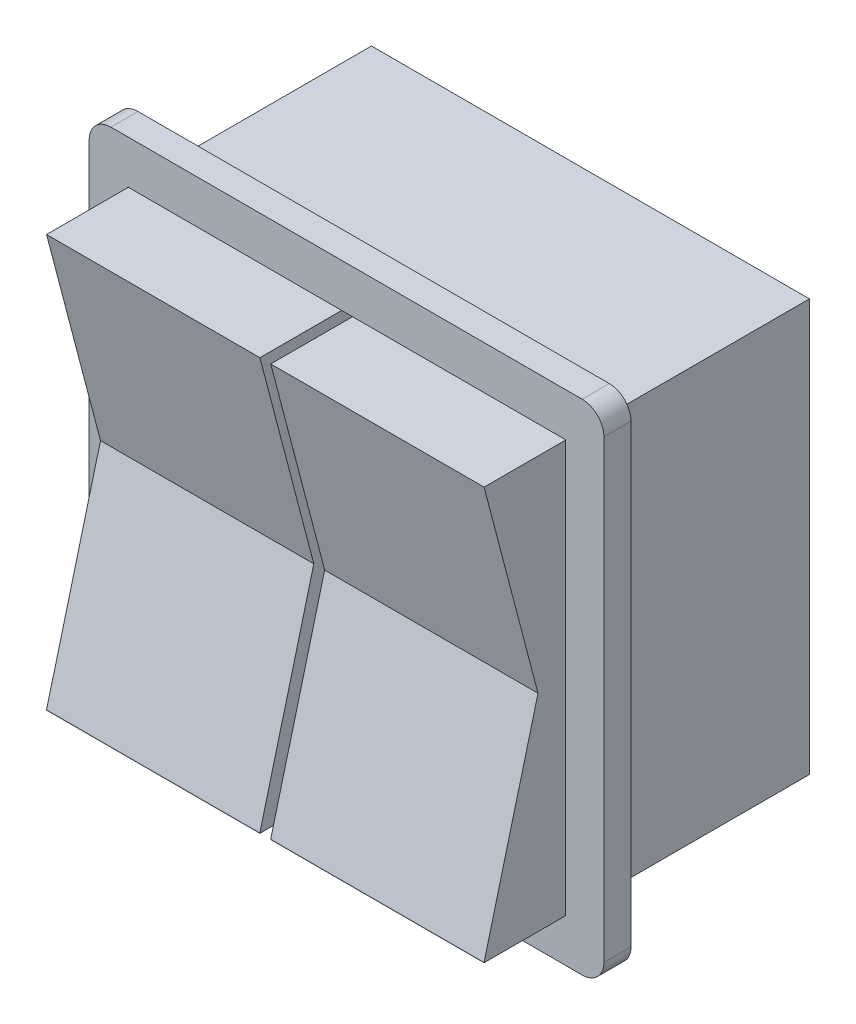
ISO-10303-21;
HEADER;
FILE_DESCRIPTION(('STEP AP214'),'2;1');
FILE_NAME('part.step','',(''),(''),'','','');
FILE_SCHEMA(('AUTOMOTIVE_DESIGN { 1 0 10303 214 1 1 1 1 }'));
ENDSEC;
DATA;
#1=APPLICATION_CONTEXT('core data for automotive mechanical design processes');
#2=APPLICATION_PROTOCOL_DEFINITION('international standard','automotive_design',2000,#1);
#3=PRODUCT_CONTEXT('',#1,'mechanical');
#4=PRODUCT('Part','Part','',(#3));
#5=PRODUCT_RELATED_PRODUCT_CATEGORY('part','',(#4));
#6=PRODUCT_DEFINITION_FORMATION('','',#4);
#7=PRODUCT_DEFINITION_CONTEXT('part definition',#1,'design');
#8=PRODUCT_DEFINITION('design','',#6,#7);
#9=PRODUCT_DEFINITION_SHAPE('','',#8);
#10=(LENGTH_UNIT() NAMED_UNIT(*) SI_UNIT(.MILLI.,.METRE.));
#11=(NAMED_UNIT(*) PLANE_ANGLE_UNIT() SI_UNIT($,.RADIAN.));
#12=(NAMED_UNIT(*) SI_UNIT($,.STERADIAN.) SOLID_ANGLE_UNIT());
#13=UNCERTAINTY_MEASURE_WITH_UNIT(LENGTH_MEASURE(1.E-05),#10,'distance_accuracy_value','');
#14=(GEOMETRIC_REPRESENTATION_CONTEXT(3) GLOBAL_UNCERTAINTY_ASSIGNED_CONTEXT((#13)) GLOBAL_UNIT_ASSIGNED_CONTEXT((#10,
#11,#12)) REPRESENTATION_CONTEXT('',''));
#15=CARTESIAN_POINT('',(0.,0.,0.));
#16=DIRECTION('',(0.,0.,1.));
#17=DIRECTION('',(1.,0.,0.));
#18=AXIS2_PLACEMENT_3D('',#15,#16,#17);
#19=CARTESIAN_POINT('',(-25.6186756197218,24.0720067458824,38.1));
#20=DIRECTION('',(0.,-1.,0.));
#21=DIRECTION('',(0.,0.,-1.));
#22=AXIS2_PLACEMENT_3D('',#19,#20,#21);
#23=PLANE('',#22);
#24=DIRECTION('',(-1.,0.,0.));
#25=VECTOR('',#24,1.);
#26=CARTESIAN_POINT('',(-25.6186756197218,24.0720067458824,25.4));
#27=LINE('',#26,#25);
#28=CARTESIAN_POINT('',(-0.626315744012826,24.0720067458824,25.4));
#29=VERTEX_POINT('',#28);
#30=CARTESIAN_POINT('',(-25.6186756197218,24.0720067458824,25.4));
#31=VERTEX_POINT('',#30);
#32=EDGE_CURVE('E65',#29,#31,#27,.T.);
#33=ORIENTED_EDGE('',*,*,#32,.T.);
#34=DIRECTION('',(0.,0.,-1.));
#35=VECTOR('',#34,1.);
#36=CARTESIAN_POINT('',(-25.6186756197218,24.0720067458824,38.1));
#37=LINE('',#36,#35);
#38=CARTESIAN_POINT('',(-25.6186756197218,24.0720067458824,38.1));
#39=VERTEX_POINT('',#38);
#40=EDGE_CURVE('E150',#39,#31,#37,.T.);
#41=ORIENTED_EDGE('',*,*,#40,.F.);
#42=DIRECTION('',(-1.,0.,0.));
#43=VECTOR('',#42,1.);
#44=CARTESIAN_POINT('',(-25.6186756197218,24.0720067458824,38.1));
#45=LINE('',#44,#43);
#46=CARTESIAN_POINT('',(-0.626315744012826,24.0720067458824,38.1));
#47=VERTEX_POINT('',#46);
#48=EDGE_CURVE('E134',#47,#39,#45,.T.);
#49=ORIENTED_EDGE('',*,*,#48,.F.);
#50=DIRECTION('',(0.,0.,-1.));
#51=VECTOR('',#50,1.);
#52=CARTESIAN_POINT('',(-0.626315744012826,24.0720067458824,38.1));
#53=LINE('',#52,#51);
#54=EDGE_CURVE('E139',#47,#29,#53,.T.);
#55=ORIENTED_EDGE('',*,*,#54,.T.);
#56=EDGE_LOOP('',(#33,#41,#49,#55));
#57=FACE_BOUND('',#56,.T.);
#58=ADVANCED_FACE('F56',(#57),#23,.F.);
#59=CARTESIAN_POINT('',(-25.6186756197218,-24.1879932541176,38.1));
#60=DIRECTION('',(1.,0.,0.));
#61=DIRECTION('',(0.,0.,-1.));
#62=AXIS2_PLACEMENT_3D('',#59,#60,#61);
#63=PLANE('',#62);
#64=DIRECTION('',(0.,-1.,0.));
#65=VECTOR('',#64,1.);
#66=CARTESIAN_POINT('',(-25.6186756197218,-24.1879932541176,38.1));
#67=LINE('',#66,#65);
#68=CARTESIAN_POINT('',(-25.6186756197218,-24.1300000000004,38.1));
#69=VERTEX_POINT('',#68);
#70=CARTESIAN_POINT('',(-25.6186756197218,-24.1879932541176,38.1));
#71=VERTEX_POINT('',#70);
#72=EDGE_CURVE('E93',#69,#71,#67,.T.);
#73=ORIENTED_EDGE('',*,*,#72,.F.);
#74=DIRECTION('',(0.,-0.967409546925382,0.253216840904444));
#75=VECTOR('',#74,1.);
#76=CARTESIAN_POINT('',(-25.6186756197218,0.,31.7840375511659));
#77=LINE('',#76,#75);
#78=CARTESIAN_POINT('',(-25.6186756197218,0.,31.7840375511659));
#79=VERTEX_POINT('',#78);
#80=EDGE_CURVE('E119',#79,#69,#77,.T.);
#81=ORIENTED_EDGE('',*,*,#80,.F.);
#82=DIRECTION('',(0.,-0.967259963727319,-0.253787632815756));
#83=VECTOR('',#82,1.);
#84=CARTESIAN_POINT('',(-25.6186756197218,0.,31.7840375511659));
#85=LINE('',#84,#83);
#86=EDGE_CURVE('E127',#39,#79,#85,.T.);
#87=ORIENTED_EDGE('',*,*,#86,.F.);
#88=ORIENTED_EDGE('',*,*,#40,.T.);
#89=DIRECTION('',(0.,-1.,0.));
#90=VECTOR('',#89,1.);
#91=CARTESIAN_POINT('',(-25.6186756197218,-24.1879932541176,25.4));
#92=LINE('',#91,#90);
#93=CARTESIAN_POINT('',(-25.6186756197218,-24.1879932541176,25.4));
#94=VERTEX_POINT('',#93);
#95=EDGE_CURVE('E73',#31,#94,#92,.T.);
#96=ORIENTED_EDGE('',*,*,#95,.T.);
#97=DIRECTION('',(0.,0.,-1.));
#98=VECTOR('',#97,1.);
#99=CARTESIAN_POINT('',(-25.6186756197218,-24.1879932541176,38.1));
#100=LINE('',#99,#98);
#101=EDGE_CURVE('E133',#71,#94,#100,.T.);
#102=ORIENTED_EDGE('',*,*,#101,.F.);
#103=EDGE_LOOP('',(#73,#81,#87,#88,#96,#102));
#104=FACE_BOUND('',#103,.T.);
#105=ADVANCED_FACE('F131',(#104),#63,.F.);
#106=CARTESIAN_POINT('',(-25.6186756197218,-24.1879932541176,38.1));
#107=DIRECTION('',(0.,1.,0.));
#108=DIRECTION('',(0.,0.,1.));
#109=AXIS2_PLACEMENT_3D('',#106,#107,#108);
#110=PLANE('',#109);
#111=DIRECTION('',(1.,0.,0.));
#112=VECTOR('',#111,1.);
#113=CARTESIAN_POINT('',(-25.6186756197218,-24.1879932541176,25.4));
#114=LINE('',#113,#112);
#115=CARTESIAN_POINT('',(-0.626315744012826,-24.1879932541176,25.4));
#116=VERTEX_POINT('',#115);
#117=EDGE_CURVE('E143',#94,#116,#114,.T.);
#118=ORIENTED_EDGE('',*,*,#117,.T.);
#119=DIRECTION('',(0.,0.,-1.));
#120=VECTOR('',#119,1.);
#121=CARTESIAN_POINT('',(-0.626315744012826,-24.1879932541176,38.1));
#122=LINE('',#121,#120);
#123=CARTESIAN_POINT('',(-0.626315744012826,-24.1879932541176,38.1));
#124=VERTEX_POINT('',#123);
#125=EDGE_CURVE('E147',#124,#116,#122,.T.);
#126=ORIENTED_EDGE('',*,*,#125,.F.);
#127=DIRECTION('',(1.,0.,0.));
#128=VECTOR('',#127,1.);
#129=CARTESIAN_POINT('',(-25.6186756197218,-24.1879932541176,38.1));
#130=LINE('',#129,#128);
#131=EDGE_CURVE('E88',#71,#124,#130,.T.);
#132=ORIENTED_EDGE('',*,*,#131,.F.);
#133=ORIENTED_EDGE('',*,*,#101,.T.);
#134=EDGE_LOOP('',(#118,#126,#132,#133));
#135=FACE_BOUND('',#134,.T.);
#136=ADVANCED_FACE('F165',(#135),#110,.F.);
#137=CARTESIAN_POINT('',(-0.626315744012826,-24.1879932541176,38.1));
#138=DIRECTION('',(-1.,0.,0.));
#139=DIRECTION('',(0.,0.,1.));
#140=AXIS2_PLACEMENT_3D('',#137,#138,#139);
#141=PLANE('',#140);
#142=DIRECTION('',(0.,-0.967259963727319,-0.253787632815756));
#143=VECTOR('',#142,1.);
#144=CARTESIAN_POINT('',(-0.626315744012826,-21.0796553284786,26.25320196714));
#145=LINE('',#144,#143);
#146=CARTESIAN_POINT('',(-0.626315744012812,0.,31.7840375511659));
#147=VERTEX_POINT('',#146);
#148=EDGE_CURVE('E154',#47,#147,#145,.T.);
#149=ORIENTED_EDGE('',*,*,#148,.T.);
#150=DIRECTION('',(0.,-0.967409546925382,0.253216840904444));
#151=VECTOR('',#150,1.);
#152=CARTESIAN_POINT('',(-0.626315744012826,-24.1842747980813,38.1142062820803));
#153=LINE('',#152,#151);
#154=CARTESIAN_POINT('',(-0.626315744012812,-24.1300000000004,38.1));
#155=VERTEX_POINT('',#154);
#156=EDGE_CURVE('E152',#147,#155,#153,.T.);
#157=ORIENTED_EDGE('',*,*,#156,.T.);
#158=DIRECTION('',(0.,1.,0.));
#159=VECTOR('',#158,1.);
#160=CARTESIAN_POINT('',(-0.626315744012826,-24.1879932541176,38.1));
#161=LINE('',#160,#159);
#162=EDGE_CURVE('E130',#124,#155,#161,.T.);
#163=ORIENTED_EDGE('',*,*,#162,.F.);
#164=ORIENTED_EDGE('',*,*,#125,.T.);
#165=DIRECTION('',(0.,1.,0.));
#166=VECTOR('',#165,1.);
#167=CARTESIAN_POINT('',(-0.626315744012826,-24.1879932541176,25.4));
#168=LINE('',#167,#166);
#169=EDGE_CURVE('E101',#116,#29,#168,.T.);
#170=ORIENTED_EDGE('',*,*,#169,.T.);
#171=ORIENTED_EDGE('',*,*,#54,.F.);
#172=EDGE_LOOP('',(#149,#157,#163,#164,#170,#171));
#173=FACE_BOUND('',#172,.T.);
#174=ADVANCED_FACE('F166',(#173),#141,.F.);
#175=CARTESIAN_POINT('',(0.,0.,38.1));
#176=DIRECTION('',(0.,0.,1.));
#177=DIRECTION('',(1.,0.,0.));
#178=AXIS2_PLACEMENT_3D('',#175,#176,#177);
#179=PLANE('',#178);
#180=DIRECTION('',(1.,0.,0.));
#181=VECTOR('',#180,1.);
#182=CARTESIAN_POINT('',(0.,-24.1300000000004,38.1));
#183=LINE('',#182,#181);
#184=EDGE_CURVE('E12',#69,#155,#183,.T.);
#185=ORIENTED_EDGE('',*,*,#184,.F.);
#186=ORIENTED_EDGE('',*,*,#72,.T.);
#187=ORIENTED_EDGE('',*,*,#131,.T.);
#188=ORIENTED_EDGE('',*,*,#162,.T.);
#189=EDGE_LOOP('',(#185,#186,#187,#188));
#190=FACE_BOUND('',#189,.T.);
#191=ADVANCED_FACE('F58',(#190),#179,.T.);
#192=CARTESIAN_POINT('',(0.,0.,25.4));
#193=DIRECTION('',(0.,0.,1.));
#194=DIRECTION('',(1.,0.,0.));
#195=AXIS2_PLACEMENT_3D('',#192,#193,#194);
#196=PLANE('',#195);
#197=ORIENTED_EDGE('',*,*,#32,.F.);
#198=ORIENTED_EDGE('',*,*,#169,.F.);
#199=ORIENTED_EDGE('',*,*,#117,.F.);
#200=ORIENTED_EDGE('',*,*,#95,.F.);
#201=EDGE_LOOP('',(#197,#198,#199,#200));
#202=FACE_BOUND('',#201,.T.);
#203=ADVANCED_FACE('F163',(#202),#196,.F.);
#204=CARTESIAN_POINT('',(228.381324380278,0.,31.7840375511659));
#205=DIRECTION('',(0.,-0.253216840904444,-0.967409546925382));
#206=DIRECTION('',(0.,0.967409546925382,-0.253216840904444));
#207=AXIS2_PLACEMENT_3D('',#204,#205,#206);
#208=PLANE('',#207);
#209=DIRECTION('',(-1.,0.,0.));
#210=VECTOR('',#209,1.);
#211=CARTESIAN_POINT('',(228.381324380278,0.,31.7840375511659));
#212=LINE('',#211,#210);
#213=EDGE_CURVE('E123',#147,#79,#212,.T.);
#214=ORIENTED_EDGE('',*,*,#213,.T.);
#215=ORIENTED_EDGE('',*,*,#80,.T.);
#216=ORIENTED_EDGE('',*,*,#184,.T.);
#217=ORIENTED_EDGE('',*,*,#156,.F.);
#218=EDGE_LOOP('',(#214,#215,#216,#217));
#219=FACE_BOUND('',#218,.T.);
#220=ADVANCED_FACE('F120',(#219),#208,.F.);
#221=CARTESIAN_POINT('',(228.381324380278,0.,31.7840375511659));
#222=DIRECTION('',(0.,0.253787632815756,-0.967259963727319));
#223=DIRECTION('',(0.,0.967259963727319,0.253787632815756));
#224=AXIS2_PLACEMENT_3D('',#221,#222,#223);
#225=PLANE('',#224);
#226=ORIENTED_EDGE('',*,*,#48,.T.);
#227=ORIENTED_EDGE('',*,*,#86,.T.);
#228=ORIENTED_EDGE('',*,*,#213,.F.);
#229=ORIENTED_EDGE('',*,*,#148,.F.);
#230=EDGE_LOOP('',(#226,#227,#228,#229));
#231=FACE_BOUND('',#230,.T.);
#232=ADVANCED_FACE('F159',(#231),#225,.F.);
#233=CLOSED_SHELL('',(#58,#105,#136,#174,#191,#203,#220,#232));
#234=MANIFOLD_SOLID_BREP('B2',#233);
#235=CARTESIAN_POINT('',(0.645544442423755,24.0720067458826,38.1));
#236=DIRECTION('',(0.,-1.,0.));
#237=DIRECTION('',(0.,0.,-1.));
#238=AXIS2_PLACEMENT_3D('',#235,#236,#237);
#239=PLANE('',#238);
#240=DIRECTION('',(-1.,0.,0.));
#241=VECTOR('',#240,1.);
#242=CARTESIAN_POINT('',(0.645544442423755,24.0720067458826,25.4));
#243=LINE('',#242,#241);
#244=CARTESIAN_POINT('',(25.6379043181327,24.0720067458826,25.4));
#245=VERTEX_POINT('',#244);
#246=CARTESIAN_POINT('',(0.645544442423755,24.0720067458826,25.4));
#247=VERTEX_POINT('',#246);
#248=EDGE_CURVE('E356',#245,#247,#243,.T.);
#249=ORIENTED_EDGE('',*,*,#248,.T.);
#250=DIRECTION('',(0.,0.,-1.));
#251=VECTOR('',#250,1.);
#252=CARTESIAN_POINT('',(0.645544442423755,24.0720067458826,38.1));
#253=LINE('',#252,#251);
#254=CARTESIAN_POINT('',(0.645544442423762,24.0720067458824,38.1));
#255=VERTEX_POINT('',#254);
#256=EDGE_CURVE('E286',#255,#247,#253,.T.);
#257=ORIENTED_EDGE('',*,*,#256,.F.);
#258=DIRECTION('',(-1.,0.,0.));
#259=VECTOR('',#258,1.);
#260=CARTESIAN_POINT('',(0.645544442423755,24.0720067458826,38.1));
#261=LINE('',#260,#259);
#262=CARTESIAN_POINT('',(25.6379043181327,24.0720067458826,38.1));
#263=VERTEX_POINT('',#262);
#264=EDGE_CURVE('E339',#263,#255,#261,.T.);
#265=ORIENTED_EDGE('',*,*,#264,.F.);
#266=DIRECTION('',(0.,0.,-1.));
#267=VECTOR('',#266,1.);
#268=CARTESIAN_POINT('',(25.6379043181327,24.0720067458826,38.1));
#269=LINE('',#268,#267);
#270=EDGE_CURVE('E362',#263,#245,#269,.T.);
#271=ORIENTED_EDGE('',*,*,#270,.T.);
#272=EDGE_LOOP('',(#249,#257,#265,#271));
#273=FACE_BOUND('',#272,.T.);
#274=ADVANCED_FACE('F278',(#273),#239,.F.);
#275=CARTESIAN_POINT('',(0.645544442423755,-24.1879932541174,38.1));
#276=DIRECTION('',(1.,0.,0.));
#277=DIRECTION('',(0.,0.,-1.));
#278=AXIS2_PLACEMENT_3D('',#275,#276,#277);
#279=PLANE('',#278);
#280=DIRECTION('',(0.,-1.,0.));
#281=VECTOR('',#280,1.);
#282=CARTESIAN_POINT('',(0.645544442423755,-24.1879932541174,38.1));
#283=LINE('',#282,#281);
#284=CARTESIAN_POINT('',(0.645544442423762,-24.1300000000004,38.1));
#285=VERTEX_POINT('',#284);
#286=CARTESIAN_POINT('',(0.645544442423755,-24.1879932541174,38.1));
#287=VERTEX_POINT('',#286);
#288=EDGE_CURVE('E324',#285,#287,#283,.T.);
#289=ORIENTED_EDGE('',*,*,#288,.F.);
#290=DIRECTION('',(0.,0.967409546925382,-0.253216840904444));
#291=VECTOR('',#290,1.);
#292=CARTESIAN_POINT('',(0.645544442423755,-24.1842747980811,38.1142062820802));
#293=LINE('',#292,#291);
#294=CARTESIAN_POINT('',(0.645544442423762,0.,31.7840375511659));
#295=VERTEX_POINT('',#294);
#296=EDGE_CURVE('E352',#285,#295,#293,.T.);
#297=ORIENTED_EDGE('',*,*,#296,.T.);
#298=DIRECTION('',(0.,0.967259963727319,0.253787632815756));
#299=VECTOR('',#298,1.);
#300=CARTESIAN_POINT('',(0.645544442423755,-21.0796553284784,26.2532019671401));
#301=LINE('',#300,#299);
#302=EDGE_CURVE('E342',#295,#255,#301,.T.);
#303=ORIENTED_EDGE('',*,*,#302,.T.);
#304=ORIENTED_EDGE('',*,*,#256,.T.);
#305=DIRECTION('',(0.,-1.,0.));
#306=VECTOR('',#305,1.);
#307=CARTESIAN_POINT('',(0.645544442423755,-24.1879932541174,25.4));
#308=LINE('',#307,#306);
#309=CARTESIAN_POINT('',(0.645544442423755,-24.1879932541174,25.4));
#310=VERTEX_POINT('',#309);
#311=EDGE_CURVE('E367',#247,#310,#308,.T.);
#312=ORIENTED_EDGE('',*,*,#311,.T.);
#313=DIRECTION('',(0.,0.,-1.));
#314=VECTOR('',#313,1.);
#315=CARTESIAN_POINT('',(0.645544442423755,-24.1879932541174,38.1));
#316=LINE('',#315,#314);
#317=EDGE_CURVE('E357',#287,#310,#316,.T.);
#318=ORIENTED_EDGE('',*,*,#317,.F.);
#319=EDGE_LOOP('',(#289,#297,#303,#304,#312,#318));
#320=FACE_BOUND('',#319,.T.);
#321=ADVANCED_FACE('F350',(#320),#279,.F.);
#322=CARTESIAN_POINT('',(0.645544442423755,-24.1879932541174,38.1));
#323=DIRECTION('',(0.,1.,0.));
#324=DIRECTION('',(0.,0.,1.));
#325=AXIS2_PLACEMENT_3D('',#322,#323,#324);
#326=PLANE('',#325);
#327=DIRECTION('',(1.,0.,0.));
#328=VECTOR('',#327,1.);
#329=CARTESIAN_POINT('',(0.645544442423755,-24.1879932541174,25.4));
#330=LINE('',#329,#328);
#331=CARTESIAN_POINT('',(25.6379043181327,-24.1879932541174,25.4));
#332=VERTEX_POINT('',#331);
#333=EDGE_CURVE('E313',#310,#332,#330,.T.);
#334=ORIENTED_EDGE('',*,*,#333,.T.);
#335=DIRECTION('',(0.,0.,-1.));
#336=VECTOR('',#335,1.);
#337=CARTESIAN_POINT('',(25.6379043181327,-24.1879932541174,38.1));
#338=LINE('',#337,#336);
#339=CARTESIAN_POINT('',(25.6379043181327,-24.1879932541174,38.1));
#340=VERTEX_POINT('',#339);
#341=EDGE_CURVE('E358',#340,#332,#338,.T.);
#342=ORIENTED_EDGE('',*,*,#341,.F.);
#343=DIRECTION('',(1.,0.,0.));
#344=VECTOR('',#343,1.);
#345=CARTESIAN_POINT('',(0.645544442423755,-24.1879932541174,38.1));
#346=LINE('',#345,#344);
#347=EDGE_CURVE('E372',#287,#340,#346,.T.);
#348=ORIENTED_EDGE('',*,*,#347,.F.);
#349=ORIENTED_EDGE('',*,*,#317,.T.);
#350=EDGE_LOOP('',(#334,#342,#348,#349));
#351=FACE_BOUND('',#350,.T.);
#352=ADVANCED_FACE('F387',(#351),#326,.F.);
#353=CARTESIAN_POINT('',(25.6379043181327,-24.1879932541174,38.1));
#354=DIRECTION('',(-1.,0.,0.));
#355=DIRECTION('',(0.,0.,1.));
#356=AXIS2_PLACEMENT_3D('',#353,#354,#355);
#357=PLANE('',#356);
#358=DIRECTION('',(0.,-0.967259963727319,-0.253787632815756));
#359=VECTOR('',#358,1.);
#360=CARTESIAN_POINT('',(25.6379043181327,-21.0796553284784,26.2532019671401));
#361=LINE('',#360,#359);
#362=CARTESIAN_POINT('',(25.6379043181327,0.,31.7840375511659));
#363=VERTEX_POINT('',#362);
#364=EDGE_CURVE('E294',#263,#363,#361,.T.);
#365=ORIENTED_EDGE('',*,*,#364,.T.);
#366=DIRECTION('',(0.,-0.967409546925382,0.253216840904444));
#367=VECTOR('',#366,1.);
#368=CARTESIAN_POINT('',(25.6379043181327,-24.1842747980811,38.1142062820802));
#369=LINE('',#368,#367);
#370=CARTESIAN_POINT('',(25.6379043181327,-24.1300000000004,38.1));
#371=VERTEX_POINT('',#370);
#372=EDGE_CURVE('E353',#363,#371,#369,.T.);
#373=ORIENTED_EDGE('',*,*,#372,.T.);
#374=DIRECTION('',(0.,1.,0.));
#375=VECTOR('',#374,1.);
#376=CARTESIAN_POINT('',(25.6379043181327,-24.1879932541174,38.1));
#377=LINE('',#376,#375);
#378=EDGE_CURVE('E364',#340,#371,#377,.T.);
#379=ORIENTED_EDGE('',*,*,#378,.F.);
#380=ORIENTED_EDGE('',*,*,#341,.T.);
#381=DIRECTION('',(0.,1.,0.));
#382=VECTOR('',#381,1.);
#383=CARTESIAN_POINT('',(25.6379043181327,-24.1879932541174,25.4));
#384=LINE('',#383,#382);
#385=EDGE_CURVE('E318',#332,#245,#384,.T.);
#386=ORIENTED_EDGE('',*,*,#385,.T.);
#387=ORIENTED_EDGE('',*,*,#270,.F.);
#388=EDGE_LOOP('',(#365,#373,#379,#380,#386,#387));
#389=FACE_BOUND('',#388,.T.);
#390=ADVANCED_FACE('F382',(#389),#357,.F.);
#391=CARTESIAN_POINT('',(0.,0.,38.1));
#392=DIRECTION('',(0.,0.,1.));
#393=DIRECTION('',(1.,0.,0.));
#394=AXIS2_PLACEMENT_3D('',#391,#392,#393);
#395=PLANE('',#394);
#396=DIRECTION('',(1.,0.,0.));
#397=VECTOR('',#396,1.);
#398=CARTESIAN_POINT('',(0.,-24.1300000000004,38.1));
#399=LINE('',#398,#397);
#400=EDGE_CURVE('E54',#285,#371,#399,.T.);
#401=ORIENTED_EDGE('',*,*,#400,.F.);
#402=ORIENTED_EDGE('',*,*,#288,.T.);
#403=ORIENTED_EDGE('',*,*,#347,.T.);
#404=ORIENTED_EDGE('',*,*,#378,.T.);
#405=EDGE_LOOP('',(#401,#402,#403,#404));
#406=FACE_BOUND('',#405,.T.);
#407=ADVANCED_FACE('F388',(#406),#395,.T.);
#408=CARTESIAN_POINT('',(0.,0.,25.4));
#409=DIRECTION('',(0.,0.,1.));
#410=DIRECTION('',(1.,0.,0.));
#411=AXIS2_PLACEMENT_3D('',#408,#409,#410);
#412=PLANE('',#411);
#413=ORIENTED_EDGE('',*,*,#248,.F.);
#414=ORIENTED_EDGE('',*,*,#385,.F.);
#415=ORIENTED_EDGE('',*,*,#333,.F.);
#416=ORIENTED_EDGE('',*,*,#311,.F.);
#417=EDGE_LOOP('',(#413,#414,#415,#416));
#418=FACE_BOUND('',#417,.T.);
#419=ADVANCED_FACE('F385',(#418),#412,.F.);
#420=CARTESIAN_POINT('',(228.381324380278,0.,31.7840375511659));
#421=DIRECTION('',(0.,-0.253216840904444,-0.967409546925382));
#422=DIRECTION('',(0.,0.967409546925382,-0.253216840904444));
#423=AXIS2_PLACEMENT_3D('',#420,#421,#422);
#424=PLANE('',#423);
#425=ORIENTED_EDGE('',*,*,#400,.T.);
#426=ORIENTED_EDGE('',*,*,#372,.F.);
#427=DIRECTION('',(-1.,0.,0.));
#428=VECTOR('',#427,1.);
#429=CARTESIAN_POINT('',(228.381324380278,0.,31.7840375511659));
#430=LINE('',#429,#428);
#431=EDGE_CURVE('E379',#363,#295,#430,.T.);
#432=ORIENTED_EDGE('',*,*,#431,.T.);
#433=ORIENTED_EDGE('',*,*,#296,.F.);
#434=EDGE_LOOP('',(#425,#426,#432,#433));
#435=FACE_BOUND('',#434,.T.);
#436=ADVANCED_FACE('F381',(#435),#424,.F.);
#437=CARTESIAN_POINT('',(228.381324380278,0.,31.7840375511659));
#438=DIRECTION('',(0.,0.253787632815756,-0.967259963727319));
#439=DIRECTION('',(0.,0.967259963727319,0.253787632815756));
#440=AXIS2_PLACEMENT_3D('',#437,#438,#439);
#441=PLANE('',#440);
#442=ORIENTED_EDGE('',*,*,#431,.F.);
#443=ORIENTED_EDGE('',*,*,#364,.F.);
#444=ORIENTED_EDGE('',*,*,#264,.T.);
#445=ORIENTED_EDGE('',*,*,#302,.F.);
#446=EDGE_LOOP('',(#442,#443,#444,#445));
#447=FACE_BOUND('',#446,.T.);
#448=ADVANCED_FACE('F341',(#447),#441,.F.);
#449=CLOSED_SHELL('',(#274,#321,#352,#390,#407,#419,#436,#448));
#450=MANIFOLD_SOLID_BREP('B6',#449);
#451=CARTESIAN_POINT('',(-27.6098,-26.67,28.575));
#452=DIRECTION('',(0.,0.,-1.));
#453=DIRECTION('',(-1.,0.,0.));
#454=AXIS2_PLACEMENT_3D('',#451,#452,#453);
#455=PLANE('',#454);
#456=CARTESIAN_POINT('',(-27.6098,-26.67,28.575));
#457=DIRECTION('',(0.,0.,1.));
#458=DIRECTION('',(-1.,0.,0.));
#459=AXIS2_PLACEMENT_3D('',#456,#457,#458);
#460=CIRCLE('',#459,2.54);
#461=CARTESIAN_POINT('',(-30.1498,-26.67,28.575));
#462=VERTEX_POINT('',#461);
#463=CARTESIAN_POINT('',(-27.6098,-29.21,28.575));
#464=VERTEX_POINT('',#463);
#465=EDGE_CURVE('E624',#462,#464,#460,.T.);
#466=ORIENTED_EDGE('',*,*,#465,.T.);
#467=DIRECTION('',(1.,0.,0.));
#468=VECTOR('',#467,1.);
#469=CARTESIAN_POINT('',(-27.6098,-29.21,28.575));
#470=LINE('',#469,#468);
#471=CARTESIAN_POINT('',(27.6098,-29.21,28.575));
#472=VERTEX_POINT('',#471);
#473=EDGE_CURVE('E627',#464,#472,#470,.T.);
#474=ORIENTED_EDGE('',*,*,#473,.T.);
#475=CARTESIAN_POINT('',(27.6098,-26.67,28.575));
#476=DIRECTION('',(0.,0.,1.));
#477=DIRECTION('',(1.,0.,0.));
#478=AXIS2_PLACEMENT_3D('',#475,#476,#477);
#479=CIRCLE('',#478,2.54);
#480=CARTESIAN_POINT('',(30.1498,-26.67,28.575));
#481=VERTEX_POINT('',#480);
#482=EDGE_CURVE('E630',#472,#481,#479,.T.);
#483=ORIENTED_EDGE('',*,*,#482,.T.);
#484=DIRECTION('',(0.,1.,0.));
#485=VECTOR('',#484,1.);
#486=CARTESIAN_POINT('',(30.1498,-26.67,28.575));
#487=LINE('',#486,#485);
#488=CARTESIAN_POINT('',(30.1498,26.67,28.575));
#489=VERTEX_POINT('',#488);
#490=EDGE_CURVE('E632',#481,#489,#487,.T.);
#491=ORIENTED_EDGE('',*,*,#490,.T.);
#492=CARTESIAN_POINT('',(27.6098,26.67,28.575));
#493=DIRECTION('',(0.,0.,1.));
#494=DIRECTION('',(-1.,0.,0.));
#495=AXIS2_PLACEMENT_3D('',#492,#493,#494);
#496=CIRCLE('',#495,2.54);
#497=CARTESIAN_POINT('',(27.6098,29.21,28.575));
#498=VERTEX_POINT('',#497);
#499=EDGE_CURVE('E634',#489,#498,#496,.T.);
#500=ORIENTED_EDGE('',*,*,#499,.T.);
#501=DIRECTION('',(-1.,0.,0.));
#502=VECTOR('',#501,1.);
#503=CARTESIAN_POINT('',(-27.6098,29.21,28.575));
#504=LINE('',#503,#502);
#505=CARTESIAN_POINT('',(-27.6098,29.21,28.575));
#506=VERTEX_POINT('',#505);
#507=EDGE_CURVE('E636',#498,#506,#504,.T.);
#508=ORIENTED_EDGE('',*,*,#507,.T.);
#509=CARTESIAN_POINT('',(-27.6098,26.67,28.575));
#510=DIRECTION('',(0.,0.,1.));
#511=DIRECTION('',(1.,0.,0.));
#512=AXIS2_PLACEMENT_3D('',#509,#510,#511);
#513=CIRCLE('',#512,2.54);
#514=CARTESIAN_POINT('',(-30.1498,26.67,28.575));
#515=VERTEX_POINT('',#514);
#516=EDGE_CURVE('E638',#506,#515,#513,.T.);
#517=ORIENTED_EDGE('',*,*,#516,.T.);
#518=DIRECTION('',(0.,-1.,0.));
#519=VECTOR('',#518,1.);
#520=CARTESIAN_POINT('',(-30.1498,-26.67,28.575));
#521=LINE('',#520,#519);
#522=EDGE_CURVE('E640',#515,#462,#521,.T.);
#523=ORIENTED_EDGE('',*,*,#522,.T.);
#524=EDGE_LOOP('',(#466,#474,#483,#491,#500,#508,#517,#523));
#525=FACE_BOUND('',#524,.T.);
#526=DIRECTION('',(0.,-1.,0.));
#527=VECTOR('',#526,1.);
#528=CARTESIAN_POINT('',(-25.654,24.13,28.575));
#529=LINE('',#528,#527);
#530=CARTESIAN_POINT('',(-25.654,24.13,28.575));
#531=VERTEX_POINT('',#530);
#532=CARTESIAN_POINT('',(-25.654,-24.13,28.575));
#533=VERTEX_POINT('',#532);
#534=EDGE_CURVE('E588',#531,#533,#529,.T.);
#535=ORIENTED_EDGE('',*,*,#534,.F.);
#536=DIRECTION('',(-1.,0.,0.));
#537=VECTOR('',#536,1.);
#538=CARTESIAN_POINT('',(-25.654,24.13,28.575));
#539=LINE('',#538,#537);
#540=CARTESIAN_POINT('',(25.654,24.13,28.575));
#541=VERTEX_POINT('',#540);
#542=EDGE_CURVE('E610',#541,#531,#539,.T.);
#543=ORIENTED_EDGE('',*,*,#542,.F.);
#544=DIRECTION('',(0.,1.,0.));
#545=VECTOR('',#544,1.);
#546=CARTESIAN_POINT('',(25.654,24.13,28.575));
#547=LINE('',#546,#545);
#548=CARTESIAN_POINT('',(25.654,-24.13,28.575));
#549=VERTEX_POINT('',#548);
#550=EDGE_CURVE('E608',#549,#541,#547,.T.);
#551=ORIENTED_EDGE('',*,*,#550,.F.);
#552=DIRECTION('',(1.,0.,0.));
#553=VECTOR('',#552,1.);
#554=CARTESIAN_POINT('',(-25.654,-24.13,28.575));
#555=LINE('',#554,#553);
#556=EDGE_CURVE('E596',#533,#549,#555,.T.);
#557=ORIENTED_EDGE('',*,*,#556,.F.);
#558=EDGE_LOOP('',(#535,#543,#551,#557));
#559=FACE_BOUND('',#558,.T.);
#560=ADVANCED_FACE('F499',(#525,#559),#455,.F.);
#561=CARTESIAN_POINT('',(-27.6098,-26.67,25.4));
#562=DIRECTION('',(0.,0.,-1.));
#563=DIRECTION('',(-1.,0.,0.));
#564=AXIS2_PLACEMENT_3D('',#561,#562,#563);
#565=PLANE('',#564);
#566=CARTESIAN_POINT('',(-27.6098,-26.67,25.4));
#567=DIRECTION('',(0.,0.,1.));
#568=DIRECTION('',(-1.,0.,0.));
#569=AXIS2_PLACEMENT_3D('',#566,#567,#568);
#570=CIRCLE('',#569,2.54);
#571=CARTESIAN_POINT('',(-30.1498,-26.67,25.4));
#572=VERTEX_POINT('',#571);
#573=CARTESIAN_POINT('',(-27.6098,-29.21,25.4));
#574=VERTEX_POINT('',#573);
#575=EDGE_CURVE('E604',#572,#574,#570,.T.);
#576=ORIENTED_EDGE('',*,*,#575,.F.);
#577=DIRECTION('',(0.,-1.,0.));
#578=VECTOR('',#577,1.);
#579=CARTESIAN_POINT('',(-30.1498,-26.67,25.4));
#580=LINE('',#579,#578);
#581=CARTESIAN_POINT('',(-30.1498,26.67,25.4));
#582=VERTEX_POINT('',#581);
#583=EDGE_CURVE('E628',#582,#572,#580,.T.);
#584=ORIENTED_EDGE('',*,*,#583,.F.);
#585=CARTESIAN_POINT('',(-27.6098,26.67,25.4));
#586=DIRECTION('',(0.,0.,1.));
#587=DIRECTION('',(1.,0.,0.));
#588=AXIS2_PLACEMENT_3D('',#585,#586,#587);
#589=CIRCLE('',#588,2.54);
#590=CARTESIAN_POINT('',(-27.6098,29.21,25.4));
#591=VERTEX_POINT('',#590);
#592=EDGE_CURVE('E655',#591,#582,#589,.T.);
#593=ORIENTED_EDGE('',*,*,#592,.F.);
#594=DIRECTION('',(-1.,0.,0.));
#595=VECTOR('',#594,1.);
#596=CARTESIAN_POINT('',(-27.6098,29.21,25.4));
#597=LINE('',#596,#595);
#598=CARTESIAN_POINT('',(27.6098,29.21,25.4));
#599=VERTEX_POINT('',#598);
#600=EDGE_CURVE('E653',#599,#591,#597,.T.);
#601=ORIENTED_EDGE('',*,*,#600,.F.);
#602=CARTESIAN_POINT('',(27.6098,26.67,25.4));
#603=DIRECTION('',(0.,0.,1.));
#604=DIRECTION('',(-1.,0.,0.));
#605=AXIS2_PLACEMENT_3D('',#602,#603,#604);
#606=CIRCLE('',#605,2.54);
#607=CARTESIAN_POINT('',(30.1498,26.67,25.4));
#608=VERTEX_POINT('',#607);
#609=EDGE_CURVE('E651',#608,#599,#606,.T.);
#610=ORIENTED_EDGE('',*,*,#609,.F.);
#611=DIRECTION('',(0.,1.,0.));
#612=VECTOR('',#611,1.);
#613=CARTESIAN_POINT('',(30.1498,-26.67,25.4));
#614=LINE('',#613,#612);
#615=CARTESIAN_POINT('',(30.1498,-26.67,25.4));
#616=VERTEX_POINT('',#615);
#617=EDGE_CURVE('E649',#616,#608,#614,.T.);
#618=ORIENTED_EDGE('',*,*,#617,.F.);
#619=CARTESIAN_POINT('',(27.6098,-26.67,25.4));
#620=DIRECTION('',(0.,0.,1.));
#621=DIRECTION('',(1.,0.,0.));
#622=AXIS2_PLACEMENT_3D('',#619,#620,#621);
#623=CIRCLE('',#622,2.54);
#624=CARTESIAN_POINT('',(27.6098,-29.21,25.4));
#625=VERTEX_POINT('',#624);
#626=EDGE_CURVE('E647',#625,#616,#623,.T.);
#627=ORIENTED_EDGE('',*,*,#626,.F.);
#628=DIRECTION('',(1.,0.,0.));
#629=VECTOR('',#628,1.);
#630=CARTESIAN_POINT('',(-27.6098,-29.21,25.4));
#631=LINE('',#630,#629);
#632=EDGE_CURVE('E645',#574,#625,#631,.T.);
#633=ORIENTED_EDGE('',*,*,#632,.F.);
#634=EDGE_LOOP('',(#576,#584,#593,#601,#610,#618,#627,#633));
#635=FACE_BOUND('',#634,.T.);
#636=DIRECTION('',(-1.,0.,0.));
#637=VECTOR('',#636,1.);
#638=CARTESIAN_POINT('',(-25.654,24.13,25.4));
#639=LINE('',#638,#637);
#640=CARTESIAN_POINT('',(25.654,24.13,25.4));
#641=VERTEX_POINT('',#640);
#642=CARTESIAN_POINT('',(-25.654,24.13,25.4));
#643=VERTEX_POINT('',#642);
#644=EDGE_CURVE('E597',#641,#643,#639,.T.);
#645=ORIENTED_EDGE('',*,*,#644,.T.);
#646=DIRECTION('',(0.,-1.,0.));
#647=VECTOR('',#646,1.);
#648=CARTESIAN_POINT('',(-25.654,24.13,25.4));
#649=LINE('',#648,#647);
#650=CARTESIAN_POINT('',(-25.654,-24.13,25.4));
#651=VERTEX_POINT('',#650);
#652=EDGE_CURVE('E522',#643,#651,#649,.T.);
#653=ORIENTED_EDGE('',*,*,#652,.T.);
#654=DIRECTION('',(1.,0.,0.));
#655=VECTOR('',#654,1.);
#656=CARTESIAN_POINT('',(-25.654,-24.13,25.4));
#657=LINE('',#656,#655);
#658=CARTESIAN_POINT('',(25.654,-24.13,25.4));
#659=VERTEX_POINT('',#658);
#660=EDGE_CURVE('E603',#651,#659,#657,.T.);
#661=ORIENTED_EDGE('',*,*,#660,.T.);
#662=DIRECTION('',(0.,1.,0.));
#663=VECTOR('',#662,1.);
#664=CARTESIAN_POINT('',(25.654,24.13,25.4));
#665=LINE('',#664,#663);
#666=EDGE_CURVE('E616',#659,#641,#665,.T.);
#667=ORIENTED_EDGE('',*,*,#666,.T.);
#668=EDGE_LOOP('',(#645,#653,#661,#667));
#669=FACE_BOUND('',#668,.T.);
#670=ADVANCED_FACE('F685',(#635,#669),#565,.T.);
#671=CARTESIAN_POINT('',(-27.6098,-26.67,28.575));
#672=DIRECTION('',(0.,0.,-1.));
#673=DIRECTION('',(-1.,0.,0.));
#674=AXIS2_PLACEMENT_3D('',#671,#672,#673);
#675=CYLINDRICAL_SURFACE('',#674,2.54);
#676=ORIENTED_EDGE('',*,*,#575,.T.);
#677=DIRECTION('',(0.,0.,-1.));
#678=VECTOR('',#677,1.);
#679=CARTESIAN_POINT('',(-27.6098,-29.21,28.575));
#680=LINE('',#679,#678);
#681=EDGE_CURVE('E276',#464,#574,#680,.T.);
#682=ORIENTED_EDGE('',*,*,#681,.F.);
#683=ORIENTED_EDGE('',*,*,#465,.F.);
#684=DIRECTION('',(0.,0.,-1.));
#685=VECTOR('',#684,1.);
#686=CARTESIAN_POINT('',(-30.1498,-26.67,28.575));
#687=LINE('',#686,#685);
#688=EDGE_CURVE('E642',#462,#572,#687,.T.);
#689=ORIENTED_EDGE('',*,*,#688,.T.);
#690=EDGE_LOOP('',(#676,#682,#683,#689));
#691=FACE_BOUND('',#690,.T.);
#692=ADVANCED_FACE('F501',(#691),#675,.T.);
#693=CARTESIAN_POINT('',(-27.6098,-29.21,28.575));
#694=DIRECTION('',(0.,1.,0.));
#695=DIRECTION('',(0.,0.,1.));
#696=AXIS2_PLACEMENT_3D('',#693,#694,#695);
#697=PLANE('',#696);
#698=ORIENTED_EDGE('',*,*,#632,.T.);
#699=DIRECTION('',(0.,0.,-1.));
#700=VECTOR('',#699,1.);
#701=CARTESIAN_POINT('',(27.6098,-29.21,28.575));
#702=LINE('',#701,#700);
#703=EDGE_CURVE('E507',#472,#625,#702,.T.);
#704=ORIENTED_EDGE('',*,*,#703,.F.);
#705=ORIENTED_EDGE('',*,*,#473,.F.);
#706=ORIENTED_EDGE('',*,*,#681,.T.);
#707=EDGE_LOOP('',(#698,#704,#705,#706));
#708=FACE_BOUND('',#707,.T.);
#709=ADVANCED_FACE('F702',(#708),#697,.F.);
#710=CARTESIAN_POINT('',(27.6098,-26.67,28.575));
#711=DIRECTION('',(0.,0.,-1.));
#712=DIRECTION('',(-1.,0.,0.));
#713=AXIS2_PLACEMENT_3D('',#710,#711,#712);
#714=CYLINDRICAL_SURFACE('',#713,2.54);
#715=ORIENTED_EDGE('',*,*,#626,.T.);
#716=DIRECTION('',(0.,0.,-1.));
#717=VECTOR('',#716,1.);
#718=CARTESIAN_POINT('',(30.1498,-26.67,28.575));
#719=LINE('',#718,#717);
#720=EDGE_CURVE('E672',#481,#616,#719,.T.);
#721=ORIENTED_EDGE('',*,*,#720,.F.);
#722=ORIENTED_EDGE('',*,*,#482,.F.);
#723=ORIENTED_EDGE('',*,*,#703,.T.);
#724=EDGE_LOOP('',(#715,#721,#722,#723));
#725=FACE_BOUND('',#724,.T.);
#726=ADVANCED_FACE('F679',(#725),#714,.T.);
#727=CARTESIAN_POINT('',(30.1498,-26.67,28.575));
#728=DIRECTION('',(-1.,0.,0.));
#729=DIRECTION('',(0.,0.,1.));
#730=AXIS2_PLACEMENT_3D('',#727,#728,#729);
#731=PLANE('',#730);
#732=ORIENTED_EDGE('',*,*,#617,.T.);
#733=DIRECTION('',(0.,0.,-1.));
#734=VECTOR('',#733,1.);
#735=CARTESIAN_POINT('',(30.1498,26.67,28.575));
#736=LINE('',#735,#734);
#737=EDGE_CURVE('E669',#489,#608,#736,.T.);
#738=ORIENTED_EDGE('',*,*,#737,.F.);
#739=ORIENTED_EDGE('',*,*,#490,.F.);
#740=ORIENTED_EDGE('',*,*,#720,.T.);
#741=EDGE_LOOP('',(#732,#738,#739,#740));
#742=FACE_BOUND('',#741,.T.);
#743=ADVANCED_FACE('F691',(#742),#731,.F.);
#744=CARTESIAN_POINT('',(27.6098,26.67,28.575));
#745=DIRECTION('',(0.,0.,-1.));
#746=DIRECTION('',(-1.,0.,0.));
#747=AXIS2_PLACEMENT_3D('',#744,#745,#746);
#748=CYLINDRICAL_SURFACE('',#747,2.54);
#749=ORIENTED_EDGE('',*,*,#609,.T.);
#750=DIRECTION('',(0.,0.,-1.));
#751=VECTOR('',#750,1.);
#752=CARTESIAN_POINT('',(27.6098,29.21,28.575));
#753=LINE('',#752,#751);
#754=EDGE_CURVE('E666',#498,#599,#753,.T.);
#755=ORIENTED_EDGE('',*,*,#754,.F.);
#756=ORIENTED_EDGE('',*,*,#499,.F.);
#757=ORIENTED_EDGE('',*,*,#737,.T.);
#758=EDGE_LOOP('',(#749,#755,#756,#757));
#759=FACE_BOUND('',#758,.T.);
#760=ADVANCED_FACE('F695',(#759),#748,.T.);
#761=CARTESIAN_POINT('',(-27.6098,29.21,28.575));
#762=DIRECTION('',(0.,-1.,0.));
#763=DIRECTION('',(0.,0.,-1.));
#764=AXIS2_PLACEMENT_3D('',#761,#762,#763);
#765=PLANE('',#764);
#766=ORIENTED_EDGE('',*,*,#600,.T.);
#767=DIRECTION('',(0.,0.,-1.));
#768=VECTOR('',#767,1.);
#769=CARTESIAN_POINT('',(-27.6098,29.21,28.575));
#770=LINE('',#769,#768);
#771=EDGE_CURVE('E663',#506,#591,#770,.T.);
#772=ORIENTED_EDGE('',*,*,#771,.F.);
#773=ORIENTED_EDGE('',*,*,#507,.F.);
#774=ORIENTED_EDGE('',*,*,#754,.T.);
#775=EDGE_LOOP('',(#766,#772,#773,#774));
#776=FACE_BOUND('',#775,.T.);
#777=ADVANCED_FACE('F715',(#776),#765,.F.);
#778=CARTESIAN_POINT('',(-27.6098,26.67,28.575));
#779=DIRECTION('',(0.,0.,-1.));
#780=DIRECTION('',(-1.,0.,0.));
#781=AXIS2_PLACEMENT_3D('',#778,#779,#780);
#782=CYLINDRICAL_SURFACE('',#781,2.54);
#783=ORIENTED_EDGE('',*,*,#592,.T.);
#784=DIRECTION('',(0.,0.,-1.));
#785=VECTOR('',#784,1.);
#786=CARTESIAN_POINT('',(-30.1498,26.67,28.575));
#787=LINE('',#786,#785);
#788=EDGE_CURVE('E660',#515,#582,#787,.T.);
#789=ORIENTED_EDGE('',*,*,#788,.F.);
#790=ORIENTED_EDGE('',*,*,#516,.F.);
#791=ORIENTED_EDGE('',*,*,#771,.T.);
#792=EDGE_LOOP('',(#783,#789,#790,#791));
#793=FACE_BOUND('',#792,.T.);
#794=ADVANCED_FACE('F713',(#793),#782,.T.);
#795=CARTESIAN_POINT('',(-30.1498,-26.67,28.575));
#796=DIRECTION('',(1.,0.,0.));
#797=DIRECTION('',(0.,0.,-1.));
#798=AXIS2_PLACEMENT_3D('',#795,#796,#797);
#799=PLANE('',#798);
#800=ORIENTED_EDGE('',*,*,#583,.T.);
#801=ORIENTED_EDGE('',*,*,#688,.F.);
#802=ORIENTED_EDGE('',*,*,#522,.F.);
#803=ORIENTED_EDGE('',*,*,#788,.T.);
#804=EDGE_LOOP('',(#800,#801,#802,#803));
#805=FACE_BOUND('',#804,.T.);
#806=ADVANCED_FACE('F708',(#805),#799,.F.);
#807=CARTESIAN_POINT('',(-25.654,24.13,28.575));
#808=DIRECTION('',(1.,0.,0.));
#809=DIRECTION('',(0.,0.,-1.));
#810=AXIS2_PLACEMENT_3D('',#807,#808,#809);
#811=PLANE('',#810);
#812=ORIENTED_EDGE('',*,*,#652,.F.);
#813=DIRECTION('',(0.,0.,-1.));
#814=VECTOR('',#813,1.);
#815=CARTESIAN_POINT('',(-25.654,24.13,28.575));
#816=LINE('',#815,#814);
#817=EDGE_CURVE('E592',#531,#643,#816,.T.);
#818=ORIENTED_EDGE('',*,*,#817,.F.);
#819=ORIENTED_EDGE('',*,*,#534,.T.);
#820=DIRECTION('',(0.,0.,-1.));
#821=VECTOR('',#820,1.);
#822=CARTESIAN_POINT('',(-25.654,-24.13,28.575));
#823=LINE('',#822,#821);
#824=EDGE_CURVE('E591',#533,#651,#823,.T.);
#825=ORIENTED_EDGE('',*,*,#824,.T.);
#826=EDGE_LOOP('',(#812,#818,#819,#825));
#827=FACE_BOUND('',#826,.T.);
#828=ADVANCED_FACE('F590',(#827),#811,.T.);
#829=CARTESIAN_POINT('',(-25.654,-24.13,28.575));
#830=DIRECTION('',(0.,1.,0.));
#831=DIRECTION('',(0.,0.,1.));
#832=AXIS2_PLACEMENT_3D('',#829,#830,#831);
#833=PLANE('',#832);
#834=ORIENTED_EDGE('',*,*,#660,.F.);
#835=ORIENTED_EDGE('',*,*,#824,.F.);
#836=ORIENTED_EDGE('',*,*,#556,.T.);
#837=DIRECTION('',(0.,0.,-1.));
#838=VECTOR('',#837,1.);
#839=CARTESIAN_POINT('',(25.654,-24.13,28.575));
#840=LINE('',#839,#838);
#841=EDGE_CURVE('E605',#549,#659,#840,.T.);
#842=ORIENTED_EDGE('',*,*,#841,.T.);
#843=EDGE_LOOP('',(#834,#835,#836,#842));
#844=FACE_BOUND('',#843,.T.);
#845=ADVANCED_FACE('F600',(#844),#833,.T.);
#846=CARTESIAN_POINT('',(25.654,24.13,28.575));
#847=DIRECTION('',(-1.,0.,0.));
#848=DIRECTION('',(0.,0.,1.));
#849=AXIS2_PLACEMENT_3D('',#846,#847,#848);
#850=PLANE('',#849);
#851=ORIENTED_EDGE('',*,*,#666,.F.);
#852=ORIENTED_EDGE('',*,*,#841,.F.);
#853=ORIENTED_EDGE('',*,*,#550,.T.);
#854=DIRECTION('',(0.,0.,-1.));
#855=VECTOR('',#854,1.);
#856=CARTESIAN_POINT('',(25.654,24.13,28.575));
#857=LINE('',#856,#855);
#858=EDGE_CURVE('E514',#541,#641,#857,.T.);
#859=ORIENTED_EDGE('',*,*,#858,.T.);
#860=EDGE_LOOP('',(#851,#852,#853,#859));
#861=FACE_BOUND('',#860,.T.);
#862=ADVANCED_FACE('F740',(#861),#850,.T.);
#863=CARTESIAN_POINT('',(-25.654,24.13,28.575));
#864=DIRECTION('',(0.,-1.,0.));
#865=DIRECTION('',(0.,0.,-1.));
#866=AXIS2_PLACEMENT_3D('',#863,#864,#865);
#867=PLANE('',#866);
#868=ORIENTED_EDGE('',*,*,#644,.F.);
#869=ORIENTED_EDGE('',*,*,#858,.F.);
#870=ORIENTED_EDGE('',*,*,#542,.T.);
#871=ORIENTED_EDGE('',*,*,#817,.T.);
#872=EDGE_LOOP('',(#868,#869,#870,#871));
#873=FACE_BOUND('',#872,.T.);
#874=ADVANCED_FACE('F744',(#873),#867,.T.);
#875=CLOSED_SHELL('',(#560,#670,#692,#709,#726,#743,#760,#777,#794,#806,#828,#845,#862,#874));
#876=MANIFOLD_SOLID_BREP('B48',#875);
#877=CARTESIAN_POINT('',(25.654,-24.13,25.4));
#878=DIRECTION('',(-1.,0.,0.));
#879=DIRECTION('',(0.,0.,1.));
#880=AXIS2_PLACEMENT_3D('',#877,#878,#879);
#881=PLANE('',#880);
#882=DIRECTION('',(0.,1.,0.));
#883=VECTOR('',#882,1.);
#884=CARTESIAN_POINT('',(25.654,-24.13,0.));
#885=LINE('',#884,#883);
#886=CARTESIAN_POINT('',(25.654,-24.13,0.));
#887=VERTEX_POINT('',#886);
#888=CARTESIAN_POINT('',(25.654,24.13,0.));
#889=VERTEX_POINT('',#888);
#890=EDGE_CURVE('E896',#887,#889,#885,.T.);
#891=ORIENTED_EDGE('',*,*,#890,.T.);
#892=DIRECTION('',(0.,0.,-1.));
#893=VECTOR('',#892,1.);
#894=CARTESIAN_POINT('',(25.654,24.13,25.4));
#895=LINE('',#894,#893);
#896=CARTESIAN_POINT('',(25.654,24.13,25.4));
#897=VERTEX_POINT('',#896);
#898=EDGE_CURVE('E497',#897,#889,#895,.T.);
#899=ORIENTED_EDGE('',*,*,#898,.F.);
#900=DIRECTION('',(0.,1.,0.));
#901=VECTOR('',#900,1.);
#902=CARTESIAN_POINT('',(25.654,-24.13,25.4));
#903=LINE('',#902,#901);
#904=CARTESIAN_POINT('',(25.654,-24.13,25.4));
#905=VERTEX_POINT('',#904);
#906=EDGE_CURVE('E884',#905,#897,#903,.T.);
#907=ORIENTED_EDGE('',*,*,#906,.F.);
#908=DIRECTION('',(0.,0.,-1.));
#909=VECTOR('',#908,1.);
#910=CARTESIAN_POINT('',(25.654,-24.13,25.4));
#911=LINE('',#910,#909);
#912=EDGE_CURVE('E892',#905,#887,#911,.T.);
#913=ORIENTED_EDGE('',*,*,#912,.T.);
#914=EDGE_LOOP('',(#891,#899,#907,#913));
#915=FACE_BOUND('',#914,.T.);
#916=ADVANCED_FACE('F833',(#915),#881,.F.);
#917=CARTESIAN_POINT('',(-25.654,24.13,25.4));
#918=DIRECTION('',(0.,-1.,0.));
#919=DIRECTION('',(0.,0.,-1.));
#920=AXIS2_PLACEMENT_3D('',#917,#918,#919);
#921=PLANE('',#920);
#922=DIRECTION('',(-1.,0.,0.));
#923=VECTOR('',#922,1.);
#924=CARTESIAN_POINT('',(-25.654,24.13,0.));
#925=LINE('',#924,#923);
#926=CARTESIAN_POINT('',(-25.654,24.13,0.));
#927=VERTEX_POINT('',#926);
#928=EDGE_CURVE('E888',#889,#927,#925,.T.);
#929=ORIENTED_EDGE('',*,*,#928,.T.);
#930=DIRECTION('',(0.,0.,-1.));
#931=VECTOR('',#930,1.);
#932=CARTESIAN_POINT('',(-25.654,24.13,25.4));
#933=LINE('',#932,#931);
#934=CARTESIAN_POINT('',(-25.654,24.13,25.4));
#935=VERTEX_POINT('',#934);
#936=EDGE_CURVE('E841',#935,#927,#933,.T.);
#937=ORIENTED_EDGE('',*,*,#936,.F.);
#938=DIRECTION('',(-1.,0.,0.));
#939=VECTOR('',#938,1.);
#940=CARTESIAN_POINT('',(-25.654,24.13,25.4));
#941=LINE('',#940,#939);
#942=EDGE_CURVE('E879',#897,#935,#941,.T.);
#943=ORIENTED_EDGE('',*,*,#942,.F.);
#944=ORIENTED_EDGE('',*,*,#898,.T.);
#945=EDGE_LOOP('',(#929,#937,#943,#944));
#946=FACE_BOUND('',#945,.T.);
#947=ADVANCED_FACE('F887',(#946),#921,.F.);
#948=CARTESIAN_POINT('',(-25.654,-24.13,25.4));
#949=DIRECTION('',(1.,0.,0.));
#950=DIRECTION('',(0.,0.,-1.));
#951=AXIS2_PLACEMENT_3D('',#948,#949,#950);
#952=PLANE('',#951);
#953=DIRECTION('',(0.,-1.,0.));
#954=VECTOR('',#953,1.);
#955=CARTESIAN_POINT('',(-25.654,-24.13,0.));
#956=LINE('',#955,#954);
#957=CARTESIAN_POINT('',(-25.654,-24.13,0.));
#958=VERTEX_POINT('',#957);
#959=EDGE_CURVE('E866',#927,#958,#956,.T.);
#960=ORIENTED_EDGE('',*,*,#959,.T.);
#961=DIRECTION('',(0.,0.,-1.));
#962=VECTOR('',#961,1.);
#963=CARTESIAN_POINT('',(-25.654,-24.13,25.4));
#964=LINE('',#963,#962);
#965=CARTESIAN_POINT('',(-25.654,-24.13,25.4));
#966=VERTEX_POINT('',#965);
#967=EDGE_CURVE('E889',#966,#958,#964,.T.);
#968=ORIENTED_EDGE('',*,*,#967,.F.);
#969=DIRECTION('',(0.,-1.,0.));
#970=VECTOR('',#969,1.);
#971=CARTESIAN_POINT('',(-25.654,-24.13,25.4));
#972=LINE('',#971,#970);
#973=EDGE_CURVE('E882',#935,#966,#972,.T.);
#974=ORIENTED_EDGE('',*,*,#973,.F.);
#975=ORIENTED_EDGE('',*,*,#936,.T.);
#976=EDGE_LOOP('',(#960,#968,#974,#975));
#977=FACE_BOUND('',#976,.T.);
#978=ADVANCED_FACE('F890',(#977),#952,.F.);
#979=CARTESIAN_POINT('',(-25.654,-24.13,25.4));
#980=DIRECTION('',(0.,1.,0.));
#981=DIRECTION('',(0.,0.,1.));
#982=AXIS2_PLACEMENT_3D('',#979,#980,#981);
#983=PLANE('',#982);
#984=DIRECTION('',(1.,0.,0.));
#985=VECTOR('',#984,1.);
#986=CARTESIAN_POINT('',(-25.654,-24.13,0.));
#987=LINE('',#986,#985);
#988=EDGE_CURVE('E872',#958,#887,#987,.T.);
#989=ORIENTED_EDGE('',*,*,#988,.T.);
#990=ORIENTED_EDGE('',*,*,#912,.F.);
#991=DIRECTION('',(1.,0.,0.));
#992=VECTOR('',#991,1.);
#993=CARTESIAN_POINT('',(-25.654,-24.13,25.4));
#994=LINE('',#993,#992);
#995=EDGE_CURVE('E849',#966,#905,#994,.T.);
#996=ORIENTED_EDGE('',*,*,#995,.F.);
#997=ORIENTED_EDGE('',*,*,#967,.T.);
#998=EDGE_LOOP('',(#989,#990,#996,#997));
#999=FACE_BOUND('',#998,.T.);
#1000=ADVANCED_FACE('F903',(#999),#983,.F.);
#1001=CARTESIAN_POINT('',(0.,0.,25.4));
#1002=DIRECTION('',(0.,0.,-1.));
#1003=DIRECTION('',(-1.,0.,0.));
#1004=AXIS2_PLACEMENT_3D('',#1001,#1002,#1003);
#1005=PLANE('',#1004);
#1006=ORIENTED_EDGE('',*,*,#906,.T.);
#1007=ORIENTED_EDGE('',*,*,#942,.T.);
#1008=ORIENTED_EDGE('',*,*,#973,.T.);
#1009=ORIENTED_EDGE('',*,*,#995,.T.);
#1010=EDGE_LOOP('',(#1006,#1007,#1008,#1009));
#1011=FACE_BOUND('',#1010,.T.);
#1012=ADVANCED_FACE('F880',(#1011),#1005,.F.);
#1013=CARTESIAN_POINT('',(0.,0.,0.));
#1014=DIRECTION('',(0.,0.,-1.));
#1015=DIRECTION('',(-1.,0.,0.));
#1016=AXIS2_PLACEMENT_3D('',#1013,#1014,#1015);
#1017=PLANE('',#1016);
#1018=ORIENTED_EDGE('',*,*,#890,.F.);
#1019=ORIENTED_EDGE('',*,*,#988,.F.);
#1020=ORIENTED_EDGE('',*,*,#959,.F.);
#1021=ORIENTED_EDGE('',*,*,#928,.F.);
#1022=EDGE_LOOP('',(#1018,#1019,#1020,#1021));
#1023=FACE_BOUND('',#1022,.T.);
#1024=ADVANCED_FACE('F906',(#1023),#1017,.T.);
#1025=CLOSED_SHELL('',(#916,#947,#978,#1000,#1012,#1024));
#1026=MANIFOLD_SOLID_BREP('B270',#1025);
#1027=ADVANCED_BREP_SHAPE_REPRESENTATION('',(#18,#234,#450,#876,#1026),#14);
#1028=SHAPE_DEFINITION_REPRESENTATION(#9,#1027);
ENDSEC;
END-ISO-10303-21;
